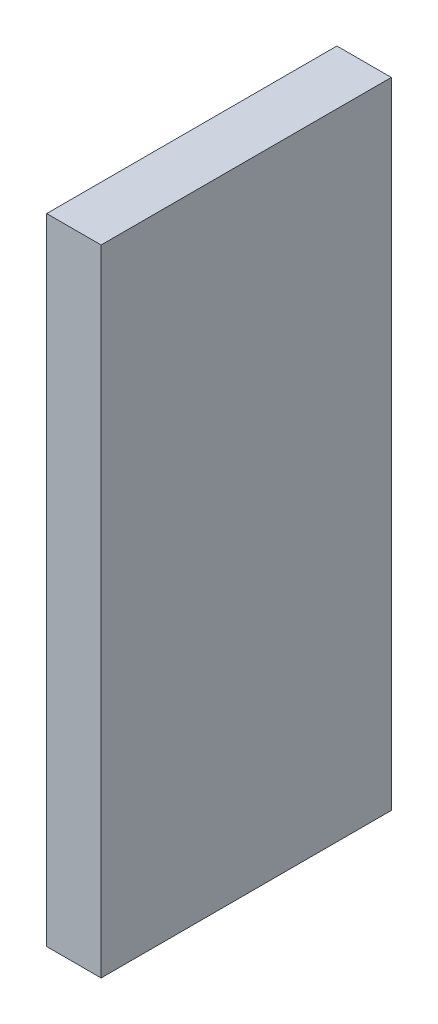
ISO-10303-21;
HEADER;
FILE_DESCRIPTION(('STEP AP214'),'2;1');
FILE_NAME('part.step','',(''),(''),'','','');
FILE_SCHEMA(('AUTOMOTIVE_DESIGN { 1 0 10303 214 1 1 1 1 }'));
ENDSEC;
DATA;
#1=APPLICATION_CONTEXT('core data for automotive mechanical design processes');
#2=APPLICATION_PROTOCOL_DEFINITION('international standard','automotive_design',2000,#1);
#3=PRODUCT_CONTEXT('',#1,'mechanical');
#4=PRODUCT('Part','Part','',(#3));
#5=PRODUCT_RELATED_PRODUCT_CATEGORY('part','',(#4));
#6=PRODUCT_DEFINITION_FORMATION('','',#4);
#7=PRODUCT_DEFINITION_CONTEXT('part definition',#1,'design');
#8=PRODUCT_DEFINITION('design','',#6,#7);
#9=PRODUCT_DEFINITION_SHAPE('','',#8);
#10=(LENGTH_UNIT() NAMED_UNIT(*) SI_UNIT(.MILLI.,.METRE.));
#11=(NAMED_UNIT(*) PLANE_ANGLE_UNIT() SI_UNIT($,.RADIAN.));
#12=(NAMED_UNIT(*) SI_UNIT($,.STERADIAN.) SOLID_ANGLE_UNIT());
#13=UNCERTAINTY_MEASURE_WITH_UNIT(LENGTH_MEASURE(1.E-05),#10,'distance_accuracy_value','');
#14=(GEOMETRIC_REPRESENTATION_CONTEXT(3) GLOBAL_UNCERTAINTY_ASSIGNED_CONTEXT((#13)) GLOBAL_UNIT_ASSIGNED_CONTEXT((#10,
#11,#12)) REPRESENTATION_CONTEXT('',''));
#15=CARTESIAN_POINT('',(0.,0.,0.));
#16=DIRECTION('',(0.,0.,1.));
#17=DIRECTION('',(1.,0.,0.));
#18=AXIS2_PLACEMENT_3D('',#15,#16,#17);
#19=CARTESIAN_POINT('',(24.,72.,-8.));
#20=DIRECTION('',(1.,0.,0.));
#21=DIRECTION('',(0.,0.,-1.));
#22=AXIS2_PLACEMENT_3D('',#19,#20,#21);
#23=PLANE('',#22);
#24=DIRECTION('',(0.,1.,0.));
#25=VECTOR('',#24,1.);
#26=CARTESIAN_POINT('',(24.,72.,8.));
#27=LINE('',#26,#25);
#28=CARTESIAN_POINT('',(24.,72.,8.));
#29=VERTEX_POINT('',#28);
#30=CARTESIAN_POINT('',(24.,107.,8.));
#31=VERTEX_POINT('',#30);
#32=EDGE_CURVE('E105',#29,#31,#27,.T.);
#33=ORIENTED_EDGE('',*,*,#32,.F.);
#34=DIRECTION('',(0.,0.,1.));
#35=VECTOR('',#34,1.);
#36=CARTESIAN_POINT('',(24.,72.,-8.));
#37=LINE('',#36,#35);
#38=CARTESIAN_POINT('',(24.,72.,-8.));
#39=VERTEX_POINT('',#38);
#40=EDGE_CURVE('E11',#39,#29,#37,.T.);
#41=ORIENTED_EDGE('',*,*,#40,.F.);
#42=DIRECTION('',(0.,1.,0.));
#43=VECTOR('',#42,1.);
#44=CARTESIAN_POINT('',(24.,72.,-8.));
#45=LINE('',#44,#43);
#46=CARTESIAN_POINT('',(24.,107.,-8.));
#47=VERTEX_POINT('',#46);
#48=EDGE_CURVE('E99',#39,#47,#45,.T.);
#49=ORIENTED_EDGE('',*,*,#48,.T.);
#50=DIRECTION('',(0.,0.,1.));
#51=VECTOR('',#50,1.);
#52=CARTESIAN_POINT('',(24.,107.,-8.));
#53=LINE('',#52,#51);
#54=EDGE_CURVE('E44',#47,#31,#53,.T.);
#55=ORIENTED_EDGE('',*,*,#54,.T.);
#56=EDGE_LOOP('',(#33,#41,#49,#55));
#57=FACE_BOUND('',#56,.T.);
#58=ADVANCED_FACE('F41',(#57),#23,.T.);
#59=CARTESIAN_POINT('',(21.,72.,-8.));
#60=DIRECTION('',(0.,-1.,0.));
#61=DIRECTION('',(0.,0.,-1.));
#62=AXIS2_PLACEMENT_3D('',#59,#60,#61);
#63=PLANE('',#62);
#64=DIRECTION('',(1.,0.,0.));
#65=VECTOR('',#64,1.);
#66=CARTESIAN_POINT('',(21.,72.,8.));
#67=LINE('',#66,#65);
#68=CARTESIAN_POINT('',(21.,72.,8.));
#69=VERTEX_POINT('',#68);
#70=EDGE_CURVE('E101',#69,#29,#67,.T.);
#71=ORIENTED_EDGE('',*,*,#70,.F.);
#72=DIRECTION('',(0.,0.,1.));
#73=VECTOR('',#72,1.);
#74=CARTESIAN_POINT('',(21.,72.,-8.));
#75=LINE('',#74,#73);
#76=CARTESIAN_POINT('',(21.,72.,-8.));
#77=VERTEX_POINT('',#76);
#78=EDGE_CURVE('E50',#77,#69,#75,.T.);
#79=ORIENTED_EDGE('',*,*,#78,.F.);
#80=DIRECTION('',(1.,0.,0.));
#81=VECTOR('',#80,1.);
#82=CARTESIAN_POINT('',(21.,72.,-8.));
#83=LINE('',#82,#81);
#84=EDGE_CURVE('E96',#77,#39,#83,.T.);
#85=ORIENTED_EDGE('',*,*,#84,.T.);
#86=ORIENTED_EDGE('',*,*,#40,.T.);
#87=EDGE_LOOP('',(#71,#79,#85,#86));
#88=FACE_BOUND('',#87,.T.);
#89=ADVANCED_FACE('F115',(#88),#63,.T.);
#90=CARTESIAN_POINT('',(21.,72.,-8.));
#91=DIRECTION('',(-1.,0.,0.));
#92=DIRECTION('',(0.,0.,1.));
#93=AXIS2_PLACEMENT_3D('',#90,#91,#92);
#94=PLANE('',#93);
#95=DIRECTION('',(0.,-1.,0.));
#96=VECTOR('',#95,1.);
#97=CARTESIAN_POINT('',(21.,72.,8.));
#98=LINE('',#97,#96);
#99=CARTESIAN_POINT('',(21.,107.,8.));
#100=VERTEX_POINT('',#99);
#101=EDGE_CURVE('E91',#100,#69,#98,.T.);
#102=ORIENTED_EDGE('',*,*,#101,.F.);
#103=DIRECTION('',(0.,0.,1.));
#104=VECTOR('',#103,1.);
#105=CARTESIAN_POINT('',(21.,107.,-8.));
#106=LINE('',#105,#104);
#107=CARTESIAN_POINT('',(21.,107.,-8.));
#108=VERTEX_POINT('',#107);
#109=EDGE_CURVE('E86',#108,#100,#106,.T.);
#110=ORIENTED_EDGE('',*,*,#109,.F.);
#111=DIRECTION('',(0.,-1.,0.));
#112=VECTOR('',#111,1.);
#113=CARTESIAN_POINT('',(21.,72.,-8.));
#114=LINE('',#113,#112);
#115=EDGE_CURVE('E89',#108,#77,#114,.T.);
#116=ORIENTED_EDGE('',*,*,#115,.T.);
#117=ORIENTED_EDGE('',*,*,#78,.T.);
#118=EDGE_LOOP('',(#102,#110,#116,#117));
#119=FACE_BOUND('',#118,.T.);
#120=ADVANCED_FACE('F88',(#119),#94,.T.);
#121=CARTESIAN_POINT('',(21.,107.,-8.));
#122=DIRECTION('',(0.,1.,0.));
#123=DIRECTION('',(0.,0.,1.));
#124=AXIS2_PLACEMENT_3D('',#121,#122,#123);
#125=PLANE('',#124);
#126=DIRECTION('',(-1.,0.,0.));
#127=VECTOR('',#126,1.);
#128=CARTESIAN_POINT('',(21.,107.,8.));
#129=LINE('',#128,#127);
#130=EDGE_CURVE('E108',#31,#100,#129,.T.);
#131=ORIENTED_EDGE('',*,*,#130,.F.);
#132=ORIENTED_EDGE('',*,*,#54,.F.);
#133=DIRECTION('',(-1.,0.,0.));
#134=VECTOR('',#133,1.);
#135=CARTESIAN_POINT('',(21.,107.,-8.));
#136=LINE('',#135,#134);
#137=EDGE_CURVE('E95',#47,#108,#136,.T.);
#138=ORIENTED_EDGE('',*,*,#137,.T.);
#139=ORIENTED_EDGE('',*,*,#109,.T.);
#140=EDGE_LOOP('',(#131,#132,#138,#139));
#141=FACE_BOUND('',#140,.T.);
#142=ADVANCED_FACE('F98',(#141),#125,.T.);
#143=CARTESIAN_POINT('',(0.,0.,-8.));
#144=DIRECTION('',(0.,0.,-1.));
#145=DIRECTION('',(-1.,0.,0.));
#146=AXIS2_PLACEMENT_3D('',#143,#144,#145);
#147=PLANE('',#146);
#148=ORIENTED_EDGE('',*,*,#48,.F.);
#149=ORIENTED_EDGE('',*,*,#84,.F.);
#150=ORIENTED_EDGE('',*,*,#115,.F.);
#151=ORIENTED_EDGE('',*,*,#137,.F.);
#152=EDGE_LOOP('',(#148,#149,#150,#151));
#153=FACE_BOUND('',#152,.T.);
#154=ADVANCED_FACE('F94',(#153),#147,.T.);
#155=CARTESIAN_POINT('',(0.,0.,8.));
#156=DIRECTION('',(0.,0.,-1.));
#157=DIRECTION('',(-1.,0.,0.));
#158=AXIS2_PLACEMENT_3D('',#155,#156,#157);
#159=PLANE('',#158);
#160=ORIENTED_EDGE('',*,*,#32,.T.);
#161=ORIENTED_EDGE('',*,*,#130,.T.);
#162=ORIENTED_EDGE('',*,*,#101,.T.);
#163=ORIENTED_EDGE('',*,*,#70,.T.);
#164=EDGE_LOOP('',(#160,#161,#162,#163));
#165=FACE_BOUND('',#164,.T.);
#166=ADVANCED_FACE('F114',(#165),#159,.F.);
#167=CLOSED_SHELL('',(#58,#89,#120,#142,#154,#166));
#168=MANIFOLD_SOLID_BREP('B2',#167);
#169=ADVANCED_BREP_SHAPE_REPRESENTATION('',(#18,#168),#14);
#170=SHAPE_DEFINITION_REPRESENTATION(#9,#169);
ENDSEC;
END-ISO-10303-21;
